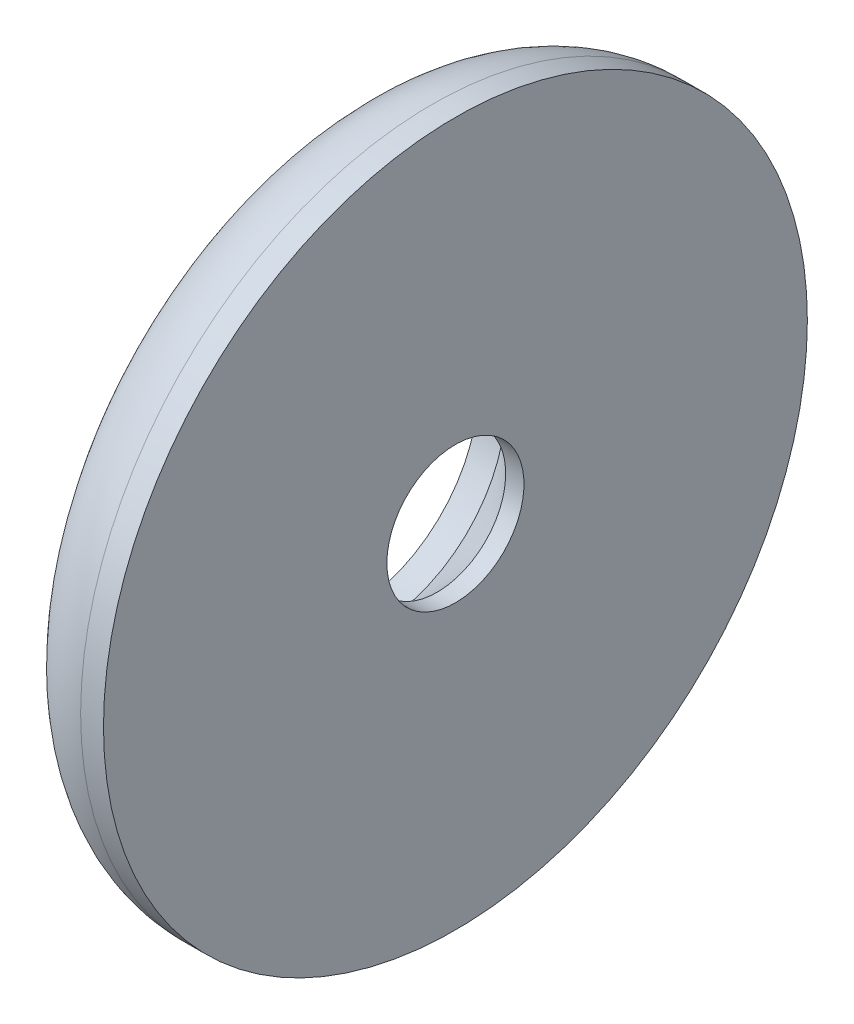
from build123d import *

# Parameters (mm, degrees)
CONG_1_R = 1.8


with BuildPart() as part:
    # Esquisse1 → R_volution1 (revolve)
    with BuildSketch(Plane.XY, mode=Mode.PRIVATE) as r_volution1_sk:
        Polygon((1.15, 1.5), (1.15, 7.7), (-1.15, 7.7), (-1.15, 2.8), (-0.55, 2.8), (0.75, 1.5), align=None)
    revolve(r_volution1_sk.sketch.rotate(Axis((-1.15, 0, 0), (1, 0, 0)), 90), axis=Axis((-1.15, 0, 0), (1, 0, 0)))

    # Cong_1
    cong_1_edges = [part.edges().sort_by_distance(p)[0] for p in [
        (-1.15, 0, -7.7),
    ]]
    fillet(cong_1_edges, radius=CONG_1_R)


solid = part.part
